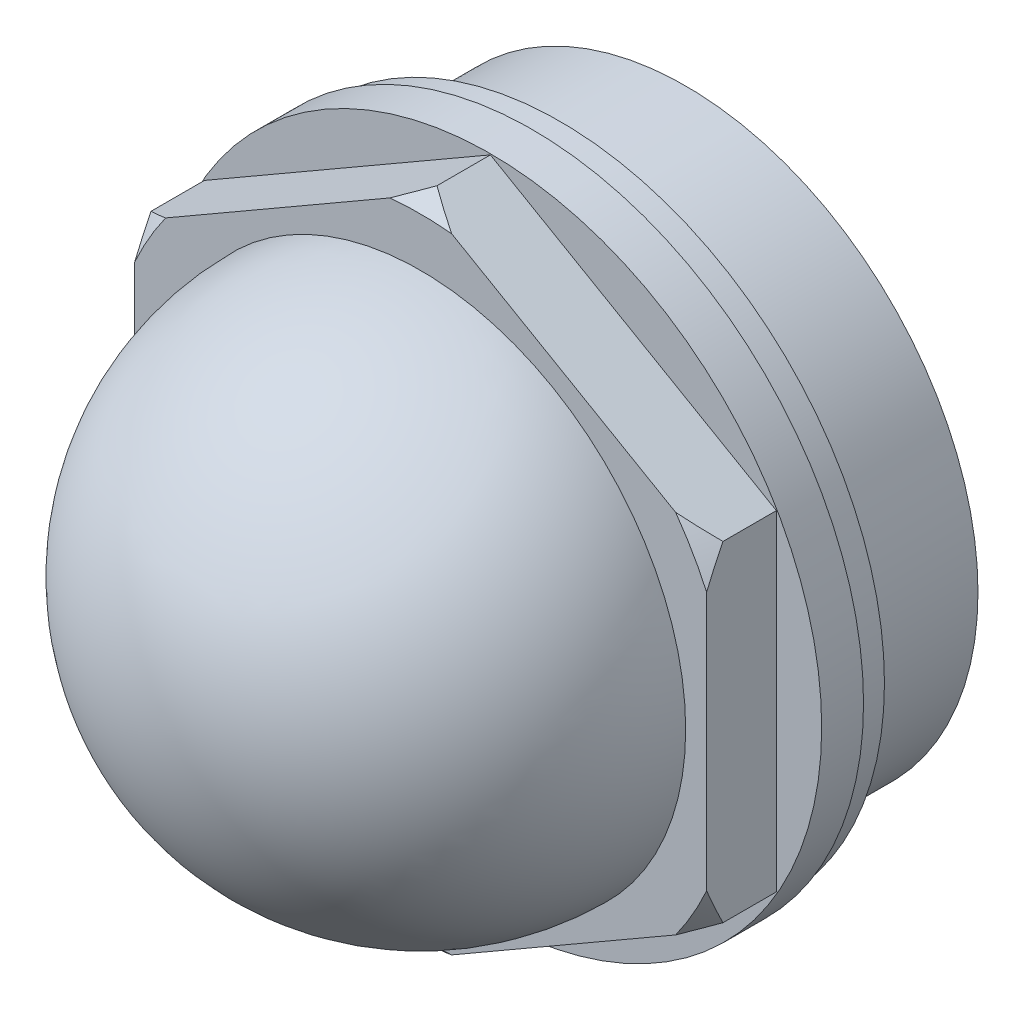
ISO-10303-21;
HEADER;
FILE_DESCRIPTION(('STEP AP214'),'2;1');
FILE_NAME('part.step','',(''),(''),'','','');
FILE_SCHEMA(('AUTOMOTIVE_DESIGN { 1 0 10303 214 1 1 1 1 }'));
ENDSEC;
DATA;
#1=APPLICATION_CONTEXT('core data for automotive mechanical design processes');
#2=APPLICATION_PROTOCOL_DEFINITION('international standard','automotive_design',2000,#1);
#3=PRODUCT_CONTEXT('',#1,'mechanical');
#4=PRODUCT('Part','Part','',(#3));
#5=PRODUCT_RELATED_PRODUCT_CATEGORY('part','',(#4));
#6=PRODUCT_DEFINITION_FORMATION('','',#4);
#7=PRODUCT_DEFINITION_CONTEXT('part definition',#1,'design');
#8=PRODUCT_DEFINITION('design','',#6,#7);
#9=PRODUCT_DEFINITION_SHAPE('','',#8);
#10=(LENGTH_UNIT() NAMED_UNIT(*) SI_UNIT(.MILLI.,.METRE.));
#11=(NAMED_UNIT(*) PLANE_ANGLE_UNIT() SI_UNIT($,.RADIAN.));
#12=(NAMED_UNIT(*) SI_UNIT($,.STERADIAN.) SOLID_ANGLE_UNIT());
#13=UNCERTAINTY_MEASURE_WITH_UNIT(LENGTH_MEASURE(1.E-05),#10,'distance_accuracy_value','');
#14=(GEOMETRIC_REPRESENTATION_CONTEXT(3) GLOBAL_UNCERTAINTY_ASSIGNED_CONTEXT((#13)) GLOBAL_UNIT_ASSIGNED_CONTEXT((#10,
#11,#12)) REPRESENTATION_CONTEXT('',''));
#15=CARTESIAN_POINT('',(0.,0.,0.));
#16=DIRECTION('',(0.,0.,1.));
#17=DIRECTION('',(1.,0.,0.));
#18=AXIS2_PLACEMENT_3D('',#15,#16,#17);
#19=CARTESIAN_POINT('',(0.,0.,-10.));
#20=DIRECTION('',(0.,0.,-1.));
#21=DIRECTION('',(1.,0.,0.));
#22=AXIS2_PLACEMENT_3D('',#19,#20,#21);
#23=PLANE('',#22);
#24=CARTESIAN_POINT('',(0.,0.,-10.));
#25=DIRECTION('',(0.,0.,-1.));
#26=DIRECTION('',(1.,0.,0.));
#27=AXIS2_PLACEMENT_3D('',#24,#25,#26);
#28=CIRCLE('',#27,19.476);
#29=CARTESIAN_POINT('',(19.476,0.,-10.));
#30=VERTEX_POINT('',#29);
#31=EDGE_CURVE('E9',#30,#30,#28,.T.);
#32=ORIENTED_EDGE('',*,*,#31,.T.);
#33=EDGE_LOOP('',(#32));
#34=FACE_BOUND('',#33,.T.);
#35=ADVANCED_FACE('F14',(#34),#23,.T.);
#36=CARTESIAN_POINT('',(0.,0.,-20.5));
#37=DIRECTION('',(0.,0.,-1.));
#38=DIRECTION('',(1.,0.,0.));
#39=AXIS2_PLACEMENT_3D('',#36,#37,#38);
#40=CYLINDRICAL_SURFACE('',#39,19.476);
#41=ORIENTED_EDGE('',*,*,#31,.F.);
#42=EDGE_LOOP('',(#41));
#43=FACE_BOUND('',#42,.T.);
#44=CARTESIAN_POINT('',(0.,0.,-9.));
#45=DIRECTION('',(0.,0.,-1.));
#46=DIRECTION('',(1.,0.,0.));
#47=AXIS2_PLACEMENT_3D('',#44,#45,#46);
#48=CIRCLE('',#47,19.476);
#49=CARTESIAN_POINT('',(19.476,0.,-9.));
#50=VERTEX_POINT('',#49);
#51=EDGE_CURVE('E21',#50,#50,#48,.T.);
#52=ORIENTED_EDGE('',*,*,#51,.T.);
#53=EDGE_LOOP('',(#52));
#54=FACE_BOUND('',#53,.T.);
#55=ADVANCED_FACE('F261',(#43,#54),#40,.T.);
#56=CARTESIAN_POINT('',(0.,-19.476,-9.));
#57=DIRECTION('',(0.,0.,-1.));
#58=DIRECTION('',(1.,0.,0.));
#59=AXIS2_PLACEMENT_3D('',#56,#57,#58);
#60=PLANE('',#59);
#61=CARTESIAN_POINT('',(0.,0.,-9.));
#62=DIRECTION('',(0.,0.,-1.));
#63=DIRECTION('',(1.,0.,0.));
#64=AXIS2_PLACEMENT_3D('',#61,#62,#63);
#65=CIRCLE('',#64,20.955);
#66=CARTESIAN_POINT('',(20.955,0.,-9.));
#67=VERTEX_POINT('',#66);
#68=EDGE_CURVE('E256',#67,#67,#65,.T.);
#69=ORIENTED_EDGE('',*,*,#68,.T.);
#70=EDGE_LOOP('',(#69));
#71=FACE_BOUND('',#70,.T.);
#72=ORIENTED_EDGE('',*,*,#51,.F.);
#73=EDGE_LOOP('',(#72));
#74=FACE_BOUND('',#73,.T.);
#75=ADVANCED_FACE('F263',(#71,#74),#60,.T.);
#76=CARTESIAN_POINT('',(0.,0.,-20.5));
#77=DIRECTION('',(0.,0.,-1.));
#78=DIRECTION('',(1.,0.,0.));
#79=AXIS2_PLACEMENT_3D('',#76,#77,#78);
#80=CYLINDRICAL_SURFACE('',#79,20.955);
#81=ORIENTED_EDGE('',*,*,#68,.F.);
#82=EDGE_LOOP('',(#81));
#83=FACE_BOUND('',#82,.T.);
#84=CARTESIAN_POINT('',(0.,0.,0.));
#85=DIRECTION('',(0.,0.,-1.));
#86=DIRECTION('',(1.,0.,0.));
#87=AXIS2_PLACEMENT_3D('',#84,#85,#86);
#88=CIRCLE('',#87,20.955);
#89=CARTESIAN_POINT('',(20.955,0.,0.));
#90=VERTEX_POINT('',#89);
#91=EDGE_CURVE('E253',#90,#90,#88,.T.);
#92=ORIENTED_EDGE('',*,*,#91,.T.);
#93=EDGE_LOOP('',(#92));
#94=FACE_BOUND('',#93,.T.);
#95=ADVANCED_FACE('F265',(#83,#94),#80,.T.);
#96=CARTESIAN_POINT('',(0.,-23.25,0.));
#97=DIRECTION('',(0.,0.,1.));
#98=DIRECTION('',(-1.,0.,0.));
#99=AXIS2_PLACEMENT_3D('',#96,#97,#98);
#100=PLANE('',#99);
#101=ORIENTED_EDGE('',*,*,#91,.F.);
#102=EDGE_LOOP('',(#101));
#103=FACE_BOUND('',#102,.T.);
#104=CARTESIAN_POINT('',(0.,0.,0.));
#105=DIRECTION('',(0.,0.,-1.));
#106=DIRECTION('',(1.,0.,0.));
#107=AXIS2_PLACEMENT_3D('',#104,#105,#106);
#108=CIRCLE('',#107,23.25);
#109=CARTESIAN_POINT('',(23.25,0.,0.));
#110=VERTEX_POINT('',#109);
#111=EDGE_CURVE('E250',#110,#110,#108,.T.);
#112=ORIENTED_EDGE('',*,*,#111,.T.);
#113=EDGE_LOOP('',(#112));
#114=FACE_BOUND('',#113,.T.);
#115=ADVANCED_FACE('F274',(#103,#114),#100,.F.);
#116=CARTESIAN_POINT('',(0.,0.,-20.5));
#117=DIRECTION('',(0.,0.,-1.));
#118=DIRECTION('',(1.,0.,0.));
#119=AXIS2_PLACEMENT_3D('',#116,#117,#118);
#120=CYLINDRICAL_SURFACE('',#119,23.25);
#121=CARTESIAN_POINT('',(0.,0.,2.));
#122=DIRECTION('',(0.,0.,-1.));
#123=DIRECTION('',(1.,0.,0.));
#124=AXIS2_PLACEMENT_3D('',#121,#122,#123);
#125=CIRCLE('',#124,23.25);
#126=CARTESIAN_POINT('',(23.25,0.,2.));
#127=VERTEX_POINT('',#126);
#128=EDGE_CURVE('E247',#127,#127,#125,.T.);
#129=ORIENTED_EDGE('',*,*,#128,.T.);
#130=EDGE_LOOP('',(#129));
#131=FACE_BOUND('',#130,.T.);
#132=ORIENTED_EDGE('',*,*,#111,.F.);
#133=EDGE_LOOP('',(#132));
#134=FACE_BOUND('',#133,.T.);
#135=ADVANCED_FACE('F480',(#131,#134),#120,.T.);
#136=CARTESIAN_POINT('',(0.,-23.25,2.));
#137=DIRECTION('',(0.,0.,-1.));
#138=DIRECTION('',(1.,0.,0.));
#139=AXIS2_PLACEMENT_3D('',#136,#137,#138);
#140=PLANE('',#139);
#141=CARTESIAN_POINT('',(0.,0.,2.));
#142=DIRECTION('',(0.,0.,-1.));
#143=DIRECTION('',(1.,0.,0.));
#144=AXIS2_PLACEMENT_3D('',#141,#142,#143);
#145=CIRCLE('',#144,23.75);
#146=CARTESIAN_POINT('',(23.75,0.,2.));
#147=VERTEX_POINT('',#146);
#148=EDGE_CURVE('E244',#147,#147,#145,.T.);
#149=ORIENTED_EDGE('',*,*,#148,.T.);
#150=EDGE_LOOP('',(#149));
#151=FACE_BOUND('',#150,.T.);
#152=ORIENTED_EDGE('',*,*,#128,.F.);
#153=EDGE_LOOP('',(#152));
#154=FACE_BOUND('',#153,.T.);
#155=ADVANCED_FACE('F470',(#151,#154),#140,.T.);
#156=CARTESIAN_POINT('',(0.,0.,-20.5));
#157=DIRECTION('',(0.,0.,-1.));
#158=DIRECTION('',(1.,0.,0.));
#159=AXIS2_PLACEMENT_3D('',#156,#157,#158);
#160=CYLINDRICAL_SURFACE('',#159,23.75);
#161=ORIENTED_EDGE('',*,*,#148,.F.);
#162=EDGE_LOOP('',(#161));
#163=FACE_BOUND('',#162,.T.);
#164=CARTESIAN_POINT('',(0.,0.,5.));
#165=DIRECTION('',(0.,0.,-1.));
#166=DIRECTION('',(1.,0.,0.));
#167=AXIS2_PLACEMENT_3D('',#164,#165,#166);
#168=CIRCLE('',#167,23.75);
#169=CARTESIAN_POINT('',(23.75,0.,5.));
#170=VERTEX_POINT('',#169);
#171=EDGE_CURVE('E240',#170,#170,#168,.T.);
#172=ORIENTED_EDGE('',*,*,#171,.T.);
#173=EDGE_LOOP('',(#172));
#174=FACE_BOUND('',#173,.T.);
#175=ADVANCED_FACE('F461',(#163,#174),#160,.T.);
#176=CARTESIAN_POINT('',(0.,-23.6713610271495,5.));
#177=DIRECTION('',(0.,0.,-1.));
#178=DIRECTION('',(1.,0.,0.));
#179=AXIS2_PLACEMENT_3D('',#176,#177,#178);
#180=PLANE('',#179);
#181=ORIENTED_EDGE('',*,*,#171,.F.);
#182=EDGE_LOOP('',(#181));
#183=FACE_BOUND('',#182,.T.);
#184=DIRECTION('',(0.,-1.,0.));
#185=VECTOR('',#184,1.);
#186=CARTESIAN_POINT('',(20.499999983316,11.8356805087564,5.));
#187=LINE('',#186,#185);
#188=CARTESIAN_POINT('',(20.499999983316,11.8356805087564,5.));
#189=VERTEX_POINT('',#188);
#190=CARTESIAN_POINT('',(20.499999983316,-11.8356805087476,5.));
#191=VERTEX_POINT('',#190);
#192=EDGE_CURVE('E124',#189,#191,#187,.T.);
#193=ORIENTED_EDGE('',*,*,#192,.T.);
#194=DIRECTION('',(-0.866025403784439,-0.5,0.));
#195=VECTOR('',#194,1.);
#196=CARTESIAN_POINT('',(20.499999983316,-11.8356805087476,5.));
#197=LINE('',#196,#195);
#198=CARTESIAN_POINT('',(7.89646126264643E-12,-23.671361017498,5.));
#199=VERTEX_POINT('',#198);
#200=EDGE_CURVE('E108',#191,#199,#197,.T.);
#201=ORIENTED_EDGE('',*,*,#200,.T.);
#202=DIRECTION('',(-0.866025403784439,0.5,0.));
#203=VECTOR('',#202,1.);
#204=CARTESIAN_POINT('',(7.89646126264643E-12,-23.671361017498,5.));
#205=LINE('',#204,#203);
#206=CARTESIAN_POINT('',(-20.4999999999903,-11.8356804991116,5.));
#207=VERTEX_POINT('',#206);
#208=EDGE_CURVE('E121',#199,#207,#205,.T.);
#209=ORIENTED_EDGE('',*,*,#208,.T.);
#210=DIRECTION('',(7.0545645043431E-10,1.,0.));
#211=VECTOR('',#210,1.);
#212=CARTESIAN_POINT('',(-20.4999999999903,-11.8356804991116,5.));
#213=LINE('',#212,#211);
#214=CARTESIAN_POINT('',(-20.5000000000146,11.835680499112,5.));
#215=VERTEX_POINT('',#214);
#216=EDGE_CURVE('E129',#207,#215,#213,.T.);
#217=ORIENTED_EDGE('',*,*,#216,.T.);
#218=DIRECTION('',(0.866025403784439,0.5,0.));
#219=VECTOR('',#218,1.);
#220=CARTESIAN_POINT('',(-20.4999999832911,11.8356805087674,5.));
#221=LINE('',#220,#219);
#222=CARTESIAN_POINT('',(2.8865798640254E-12,23.6713610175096,5.));
#223=VERTEX_POINT('',#222);
#224=EDGE_CURVE('E28',#215,#223,#221,.T.);
#225=ORIENTED_EDGE('',*,*,#224,.T.);
#226=DIRECTION('',(0.866025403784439,-0.5,0.));
#227=VECTOR('',#226,1.);
#228=CARTESIAN_POINT('',(2.8865798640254E-12,23.6713610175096,5.));
#229=LINE('',#228,#227);
#230=EDGE_CURVE('E135',#223,#189,#229,.T.);
#231=ORIENTED_EDGE('',*,*,#230,.T.);
#232=EDGE_LOOP('',(#193,#201,#209,#217,#225,#231));
#233=FACE_BOUND('',#232,.T.);
#234=ADVANCED_FACE('F120',(#183,#233),#180,.F.);
#235=CARTESIAN_POINT('',(20.499999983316,-11.8356805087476,5.));
#236=DIRECTION('',(-0.5,0.866025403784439,0.));
#237=DIRECTION('',(0.866025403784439,0.5,0.));
#238=AXIS2_PLACEMENT_3D('',#235,#236,#237);
#239=PLANE('',#238);
#240=DIRECTION('',(0.,0.,1.));
#241=VECTOR('',#240,1.);
#242=CARTESIAN_POINT('',(7.89646126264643E-12,-23.671361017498,5.));
#243=LINE('',#242,#241);
#244=CARTESIAN_POINT('',(7.89646126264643E-12,-23.671361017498,8.828638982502));
#245=VERTEX_POINT('',#244);
#246=EDGE_CURVE('E104',#199,#245,#243,.T.);
#247=ORIENTED_EDGE('',*,*,#246,.F.);
#248=ORIENTED_EDGE('',*,*,#200,.F.);
#249=DIRECTION('',(0.,0.,1.));
#250=VECTOR('',#249,1.);
#251=CARTESIAN_POINT('',(20.499999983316,-11.8356805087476,5.));
#252=LINE('',#251,#250);
#253=CARTESIAN_POINT('',(20.499999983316,-11.8356805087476,8.828638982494));
#254=VERTEX_POINT('',#253);
#255=EDGE_CURVE('E138',#191,#254,#252,.T.);
#256=ORIENTED_EDGE('',*,*,#255,.T.);
#257=CARTESIAN_POINT('',(-0.932149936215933,-24.209538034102,8.27252313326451));
#258=CARTESIAN_POINT('',(-0.631278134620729,-24.0358296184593,8.45765667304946));
#259=CARTESIAN_POINT('',(-0.328477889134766,-23.8610078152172,8.63867011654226));
#260=CARTESIAN_POINT('',(0.281284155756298,-23.5089615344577,8.99133702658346));
#261=CARTESIAN_POINT('',(0.588247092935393,-23.3317364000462,9.1629878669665));
#262=CARTESIAN_POINT('',(1.20769231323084,-22.9740995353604,9.49636216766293));
#263=CARTESIAN_POINT('',(1.52019160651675,-22.7936779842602,9.65804374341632));
#264=CARTESIAN_POINT('',(2.14960713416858,-22.4302847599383,9.96934084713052));
#265=CARTESIAN_POINT('',(2.46652301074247,-22.2473132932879,10.1189573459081));
#266=CARTESIAN_POINT('',(3.42600532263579,-21.6933559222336,10.5483478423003));
#267=CARTESIAN_POINT('',(4.07566559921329,-21.3182743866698,10.8077633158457));
#268=CARTESIAN_POINT('',(5.06252728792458,-20.7485095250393,11.1458794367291));
#269=CARTESIAN_POINT('',(5.39329054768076,-20.557543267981,11.2500246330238));
#270=CARTESIAN_POINT('',(6.05876635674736,-20.1733306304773,11.4397674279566));
#271=CARTESIAN_POINT('',(6.39347816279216,-19.9800846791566,11.5253684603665));
#272=CARTESIAN_POINT('',(7.01566278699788,-19.6208662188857,11.6650980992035));
#273=CARTESIAN_POINT('',(7.30266500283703,-19.4551654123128,11.7220242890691));
#274=CARTESIAN_POINT('',(7.8783264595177,-19.1228071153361,11.8204979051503));
#275=CARTESIAN_POINT('',(8.1669836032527,-18.9561508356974,11.8620616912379));
#276=CARTESIAN_POINT('',(8.90116892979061,-18.5322687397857,11.9472619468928));
#277=CARTESIAN_POINT('',(9.34768564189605,-18.2744721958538,11.9800225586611));
#278=CARTESIAN_POINT('',(10.2417216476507,-17.758300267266,12.0064971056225));
#279=CARTESIAN_POINT('',(10.6892412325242,-17.4999247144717,12.000197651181));
#280=CARTESIAN_POINT('',(11.5848019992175,-16.9828724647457,11.9486598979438));
#281=CARTESIAN_POINT('',(12.0328348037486,-16.7242006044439,11.9032290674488));
#282=CARTESIAN_POINT('',(12.9247577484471,-16.2092486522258,11.7749424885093));
#283=CARTESIAN_POINT('',(13.3686485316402,-15.9529681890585,11.6920926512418));
#284=CARTESIAN_POINT('',(14.1480865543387,-15.5029594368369,11.5151715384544));
#285=CARTESIAN_POINT('',(14.4848598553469,-15.3085232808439,11.4281719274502));
#286=CARTESIAN_POINT('',(15.15438154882,-14.9219747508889,11.2354649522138));
#287=CARTESIAN_POINT('',(15.4871294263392,-14.7298626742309,11.129755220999));
#288=CARTESIAN_POINT('',(16.4796411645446,-14.1568357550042,10.7868082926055));
#289=CARTESIAN_POINT('',(17.1328593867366,-13.779700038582,10.5239455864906));
#290=CARTESIAN_POINT('',(18.0956027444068,-13.2238599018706,10.090043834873));
#291=CARTESIAN_POINT('',(18.4123345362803,-13.0409947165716,9.93954472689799));
#292=CARTESIAN_POINT('',(19.0413842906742,-12.6778126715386,9.62656805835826));
#293=CARTESIAN_POINT('',(19.3537019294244,-12.4974959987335,9.46408962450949));
#294=CARTESIAN_POINT('',(19.9728838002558,-12.1400111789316,9.12915327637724));
#295=CARTESIAN_POINT('',(20.2797637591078,-11.9628339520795,8.95673389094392));
#296=CARTESIAN_POINT('',(20.8893722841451,-11.610876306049,8.60259181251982));
#297=CARTESIAN_POINT('',(21.192101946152,-11.4360952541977,8.42087163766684));
#298=CARTESIAN_POINT('',(21.4929091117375,-11.2624241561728,8.235059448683));
#299=B_SPLINE_CURVE_WITH_KNOTS('',3,(#257,#258,#259,#260,#261,#262,#263,#264,#265,#266,#267,
#268,#269,#270,#271,#272,#273,#274,#275,#276,#277,#278,#279,#280,#281,#282,#283,#284,#285,#286,
#287,#288,#289,#290,#291,#292,#293,#294,#295,#296,#297,#298),.UNSPECIFIED.,.F.,.F.,(4,2,2,2,2,2,
2,2,2,2,2,2,2,2,2,2,2,2,2,2,4),(0.,1.18100812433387,2.36234583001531,3.54834911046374,
4.73425686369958,7.11235226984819,8.29962168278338,9.48667106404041,10.4950969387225,
11.5024457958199,13.0508162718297,14.5997175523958,16.1562834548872,17.7126035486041,
18.9075760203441,20.1026997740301,22.4958137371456,23.6821388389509,24.8685505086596,
26.0506382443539,27.2324076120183),.UNSPECIFIED.);
#300=CARTESIAN_POINT('',(18.2811892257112,-13.1167114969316,10.));
#301=VERTEX_POINT('',#300);
#302=EDGE_CURVE('E226',#301,#254,#299,.T.);
#303=ORIENTED_EDGE('',*,*,#302,.F.);
#304=DIRECTION('',(-0.866025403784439,-0.5,0.));
#305=VECTOR('',#304,1.);
#306=CARTESIAN_POINT('',(20.499999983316,-11.8356805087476,10.));
#307=LINE('',#306,#305);
#308=CARTESIAN_POINT('',(2.21881075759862,-22.390330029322,10.));
#309=VERTEX_POINT('',#308);
#310=EDGE_CURVE('E422',#301,#309,#307,.T.);
#311=ORIENTED_EDGE('',*,*,#310,.T.);
#312=EDGE_CURVE('E110',#245,#309,#299,.T.);
#313=ORIENTED_EDGE('',*,*,#312,.F.);
#314=EDGE_LOOP('',(#247,#248,#256,#303,#311,#313));
#315=FACE_BOUND('',#314,.T.);
#316=ADVANCED_FACE('F106',(#315),#239,.F.);
#317=CARTESIAN_POINT('',(7.89646126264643E-12,-23.671361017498,5.));
#318=DIRECTION('',(0.5,0.866025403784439,0.));
#319=DIRECTION('',(0.866025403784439,-0.5,0.));
#320=AXIS2_PLACEMENT_3D('',#317,#318,#319);
#321=PLANE('',#320);
#322=DIRECTION('',(0.,0.,1.));
#323=VECTOR('',#322,1.);
#324=CARTESIAN_POINT('',(-20.4999999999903,-11.8356804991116,5.));
#325=LINE('',#324,#323);
#326=CARTESIAN_POINT('',(-20.4999999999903,-11.8356804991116,8.82863897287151));
#327=VERTEX_POINT('',#326);
#328=EDGE_CURVE('E115',#207,#327,#325,.T.);
#329=ORIENTED_EDGE('',*,*,#328,.F.);
#330=ORIENTED_EDGE('',*,*,#208,.F.);
#331=ORIENTED_EDGE('',*,*,#246,.T.);
#332=CARTESIAN_POINT('',(-21.4929091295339,-11.262424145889,8.23505943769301));
#333=CARTESIAN_POINT('',(-21.1912557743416,-11.4365837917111,8.42139412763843));
#334=CARTESIAN_POINT('',(-20.8876690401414,-11.611859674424,8.60361404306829));
#335=CARTESIAN_POINT('',(-20.2763197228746,-11.9648223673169,8.95870149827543));
#336=CARTESIAN_POINT('',(-19.9685559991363,-12.142509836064,9.13156641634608));
#337=CARTESIAN_POINT('',(-19.3474822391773,-12.5010869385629,9.46738053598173));
#338=CARTESIAN_POINT('',(-19.0341550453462,-12.6819864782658,9.63028768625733));
#339=CARTESIAN_POINT('',(-18.4030596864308,-13.0463495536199,9.9440332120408));
#340=CARTESIAN_POINT('',(-18.0852918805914,-13.229812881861,10.0948725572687));
#341=CARTESIAN_POINT('',(-17.1231752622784,-13.7852911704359,10.5279362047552));
#342=CARTESIAN_POINT('',(-16.4716861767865,-14.1614285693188,10.7897847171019));
#343=CARTESIAN_POINT('',(-15.4819546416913,-14.7328503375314,11.1314279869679));
#344=CARTESIAN_POINT('',(-15.1502153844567,-14.9243800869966,11.2367274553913));
#345=CARTESIAN_POINT('',(-14.4827397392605,-15.3097473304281,11.4287182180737));
#346=CARTESIAN_POINT('',(-14.1470041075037,-15.5035843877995,11.5154129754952));
#347=CARTESIAN_POINT('',(-13.5235263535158,-15.8635494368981,11.6569412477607));
#348=CARTESIAN_POINT('',(-13.2362674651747,-16.029398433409,11.7146168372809));
#349=CARTESIAN_POINT('',(-12.6600616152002,-16.3620710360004,11.8145843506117));
#350=CARTESIAN_POINT('',(-12.3711167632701,-16.5288934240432,11.8568925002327));
#351=CARTESIAN_POINT('',(-11.6368936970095,-16.952797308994,11.9438743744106));
#352=CARTESIAN_POINT('',(-11.1906119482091,-17.2104581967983,11.9777232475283));
#353=CARTESIAN_POINT('',(-10.2969735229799,-17.7264005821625,12.006420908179));
#354=CARTESIAN_POINT('',(-9.8496165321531,-17.9846822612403,12.0012564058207));
#355=CARTESIAN_POINT('',(-8.95432563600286,-18.5015787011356,11.9519961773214));
#356=CARTESIAN_POINT('',(-8.50639967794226,-18.7601888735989,11.9077094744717));
#357=CARTESIAN_POINT('',(-7.61462113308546,-19.2750574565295,11.7816711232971));
#358=CARTESIAN_POINT('',(-7.170767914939,-19.5313162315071,11.699925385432));
#359=CARTESIAN_POINT('',(-6.39241528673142,-19.9806983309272,11.5251344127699));
#360=CARTESIAN_POINT('',(-6.05668749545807,-20.1745308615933,11.439237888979));
#361=CARTESIAN_POINT('',(-5.38920652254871,-20.5599011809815,11.2487963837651));
#362=CARTESIAN_POINT('',(-5.05745361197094,-20.751438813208,11.1442501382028));
#363=CARTESIAN_POINT('',(-4.39789411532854,-21.132235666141,10.9180532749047));
#364=CARTESIAN_POINT('',(-4.07009337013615,-21.3214915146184,10.7963800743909));
#365=CARTESIAN_POINT('',(-3.41900419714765,-21.6973980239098,10.5377128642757));
#366=CARTESIAN_POINT('',(-3.09571665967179,-21.8840481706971,10.4007158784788));
#367=CARTESIAN_POINT('',(-2.45703665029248,-22.2527902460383,10.1145275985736));
#368=CARTESIAN_POINT('',(-2.14159724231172,-22.434909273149,9.96547541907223));
#369=CARTESIAN_POINT('',(-1.51510159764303,-22.7966167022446,9.65542819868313));
#370=CARTESIAN_POINT('',(-1.20404610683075,-22.976204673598,9.4944311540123));
#371=CARTESIAN_POINT('',(-0.586391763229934,-23.3328075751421,9.16195781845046));
#372=CARTESIAN_POINT('',(-0.279790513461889,-23.5098238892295,8.99048744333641));
#373=CARTESIAN_POINT('',(0.329232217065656,-23.8614433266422,8.63821954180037));
#374=CARTESIAN_POINT('',(0.631655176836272,-24.0360473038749,8.45742542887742));
#375=CARTESIAN_POINT('',(0.932149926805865,-24.20953802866,8.27252313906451));
#376=B_SPLINE_CURVE_WITH_KNOTS('',3,(#332,#333,#334,#335,#336,#337,#338,#339,#340,#341,#342,
#343,#344,#345,#346,#347,#348,#349,#350,#351,#352,#353,#354,#355,#356,#357,#358,#359,#360,#361,
#362,#363,#364,#365,#366,#367,#368,#369,#370,#371,#372,#373,#374,#375),.UNSPECIFIED.,.F.,.F.,(4,
2,2,2,2,2,2,2,2,2,2,2,2,2,2,2,2,2,2,2,2,4),(0.,1.18509371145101,2.37051783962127,
3.56064404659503,4.75067452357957,7.13714376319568,8.32858718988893,9.51980864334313,
10.529493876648,11.5381099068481,13.0858835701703,14.6341845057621,16.1900855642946,
17.7457412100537,18.9364777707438,20.1272950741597,21.3196975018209,22.5123319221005,
23.6927633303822,24.8733932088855,26.0533622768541,27.2329023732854),.UNSPECIFIED.);
#377=CARTESIAN_POINT('',(-2.21881075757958,-22.390330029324,10.));
#378=VERTEX_POINT('',#377);
#379=EDGE_CURVE('E219',#378,#245,#376,.T.);
#380=ORIENTED_EDGE('',*,*,#379,.F.);
#381=DIRECTION('',(-0.866025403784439,0.5,0.));
#382=VECTOR('',#381,1.);
#383=CARTESIAN_POINT('',(7.89646126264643E-12,-23.671361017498,10.));
#384=LINE('',#383,#382);
#385=CARTESIAN_POINT('',(-18.2811892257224,-13.116711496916,10.));
#386=VERTEX_POINT('',#385);
#387=EDGE_CURVE('E413',#378,#386,#384,.T.);
#388=ORIENTED_EDGE('',*,*,#387,.T.);
#389=EDGE_CURVE('E225',#327,#386,#376,.T.);
#390=ORIENTED_EDGE('',*,*,#389,.F.);
#391=EDGE_LOOP('',(#329,#330,#331,#380,#388,#390));
#392=FACE_BOUND('',#391,.T.);
#393=ADVANCED_FACE('F127',(#392),#321,.F.);
#394=CARTESIAN_POINT('',(-20.4999999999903,-11.8356804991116,5.));
#395=DIRECTION('',(1.,-7.0545645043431E-10,0.));
#396=DIRECTION('',(-7.0545645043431E-10,-1.,0.));
#397=AXIS2_PLACEMENT_3D('',#394,#395,#396);
#398=PLANE('',#397);
#399=DIRECTION('',(0.,0.,1.));
#400=VECTOR('',#399,1.);
#401=CARTESIAN_POINT('',(-20.4999999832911,11.8356805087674,5.));
#402=LINE('',#401,#400);
#403=CARTESIAN_POINT('',(-20.4999999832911,11.8356805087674,8.82863898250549));
#404=VERTEX_POINT('',#403);
#405=EDGE_CURVE('E145',#215,#404,#402,.T.);
#406=ORIENTED_EDGE('',*,*,#405,.F.);
#407=ORIENTED_EDGE('',*,*,#216,.F.);
#408=ORIENTED_EDGE('',*,*,#328,.T.);
#409=CARTESIAN_POINT('',(-20.4999999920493,-0.579203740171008,11.9918192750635));
#410=CARTESIAN_POINT('',(-20.4999999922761,-0.900717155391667,11.9827765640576));
#411=CARTESIAN_POINT('',(-20.4999999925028,-1.22199617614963,11.9661114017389));
#412=CARTESIAN_POINT('',(-20.4999999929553,-1.86337981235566,11.9179604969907));
#413=CARTESIAN_POINT('',(-20.4999999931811,-2.18348465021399,11.8864777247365));
#414=CARTESIAN_POINT('',(-20.4999999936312,-2.82145211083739,11.8091715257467));
#415=CARTESIAN_POINT('',(-20.4999999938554,-3.13931742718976,11.7633702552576));
#416=CARTESIAN_POINT('',(-20.4999999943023,-3.77276072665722,11.6580676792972));
#417=CARTESIAN_POINT('',(-20.4999999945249,-4.08833862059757,11.5985658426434));
#418=CARTESIAN_POINT('',(-20.499999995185,-5.02401631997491,11.4020873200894));
#419=CARTESIAN_POINT('',(-20.4999999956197,-5.64021507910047,11.2462376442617));
#420=CARTESIAN_POINT('',(-20.4999999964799,-6.85962826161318,10.8906537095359));
#421=CARTESIAN_POINT('',(-20.4999999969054,-7.46284259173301,10.6909191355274));
#422=CARTESIAN_POINT('',(-20.4999999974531,-8.23917285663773,10.4068809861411));
#423=CARTESIAN_POINT('',(-20.4999999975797,-8.41857157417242,10.3393329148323));
#424=CARTESIAN_POINT('',(-20.4999999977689,-8.68685137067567,10.2355760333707));
#425=CARTESIAN_POINT('',(-20.499999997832,-8.77619300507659,10.200563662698));
#426=CARTESIAN_POINT('',(-20.4999999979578,-8.95456178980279,10.129763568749));
#427=CARTESIAN_POINT('',(-20.4999999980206,-9.04358895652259,10.093975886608));
#428=CARTESIAN_POINT('',(-20.4999999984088,-9.594110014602,9.86995165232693));
#429=CARTESIAN_POINT('',(-20.4999999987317,-10.0516462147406,9.67188723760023));
#430=CARTESIAN_POINT('',(-20.4999999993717,-10.958750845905,9.2582008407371));
#431=CARTESIAN_POINT('',(-20.4999999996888,-11.4083176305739,9.04257528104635));
#432=CARTESIAN_POINT('',(-20.500000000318,-12.3002280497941,8.59609937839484));
#433=CARTESIAN_POINT('',(-20.5000000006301,-12.7425660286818,8.36523776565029));
#434=CARTESIAN_POINT('',(-20.5000000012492,-13.6201908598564,7.89058359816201));
#435=CARTESIAN_POINT('',(-20.5000000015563,-14.0554781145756,7.64679178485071));
#436=CARTESIAN_POINT('',(-20.5000000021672,-14.9215193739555,7.14696974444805));
#437=CARTESIAN_POINT('',(-20.5000000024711,-15.3522448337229,6.89089018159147));
#438=CARTESIAN_POINT('',(-20.5000000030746,-16.2077774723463,6.3690382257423));
#439=CARTESIAN_POINT('',(-20.5000000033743,-16.6325845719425,6.10326570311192));
#440=CARTESIAN_POINT('',(-20.5000000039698,-17.4766712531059,5.56343012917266));
#441=CARTESIAN_POINT('',(-20.5000000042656,-17.8959527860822,5.28937012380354));
#442=CARTESIAN_POINT('',(-20.5000000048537,-18.7296581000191,4.73394960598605));
#443=CARTESIAN_POINT('',(-20.5000000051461,-19.1440817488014,4.45258889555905));
#444=CARTESIAN_POINT('',(-20.5000000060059,-20.3629700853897,3.61126288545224));
#445=CARTESIAN_POINT('',(-20.5000000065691,-21.1612338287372,3.04230581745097));
#446=CARTESIAN_POINT('',(-20.5000000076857,-22.7440118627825,1.88548263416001));
#447=CARTESIAN_POINT('',(-20.5000000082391,-23.5285245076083,1.29761427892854));
#448=CARTESIAN_POINT('',(-20.5000000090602,-24.6924997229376,0.407818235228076));
#449=CARTESIAN_POINT('',(-20.500000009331,-25.0762923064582,0.111530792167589));
#450=CARTESIAN_POINT('',(-20.5000000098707,-25.8413197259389,-0.484332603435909));
#451=CARTESIAN_POINT('',(-20.5000000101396,-26.2225545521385,-0.783908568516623));
#452=CARTESIAN_POINT('',(-20.5000000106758,-26.9825720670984,-1.38591724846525));
#453=CARTESIAN_POINT('',(-20.500000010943,-27.3613554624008,-1.68834907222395));
#454=CARTESIAN_POINT('',(-20.5000000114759,-28.1167734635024,-2.29587224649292));
#455=CARTESIAN_POINT('',(-20.5000000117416,-28.4934081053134,-2.60096355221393));
#456=CARTESIAN_POINT('',(-20.5000000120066,-28.869068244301,-2.90724645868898));
#457=B_SPLINE_CURVE_WITH_KNOTS('',3,(#409,#410,#411,#412,#413,#414,#415,#416,#417,#418,#419,
#420,#421,#422,#423,#424,#425,#426,#427,#428,#429,#430,#431,#432,#433,#434,#435,#436,#437,#438,
#439,#440,#441,#442,#443,#444,#445,#446,#447,#448,#449,#450,#451,#452,#453,#454,#455,#456),
.UNSPECIFIED.,.F.,.F.,(4,2,2,2,2,2,2,2,2,2,2,2,2,2,2,2,2,2,2,2,2,2,2,4),(0.,0.964801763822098,
1.92941021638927,2.89253337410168,3.85569387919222,5.76045032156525,7.66522044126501,
8.2402878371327,8.52815458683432,8.8160061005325,10.3112050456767,11.8067093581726,
13.3033325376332,14.7998699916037,16.3030228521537,17.8061958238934,19.3088228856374,
20.8114907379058,23.751916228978,26.692691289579,28.1472373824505,29.601789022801,
31.055900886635,32.5099883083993),.UNSPECIFIED.);
#458=CARTESIAN_POINT('',(-20.4999999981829,-9.27361849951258,10.));
#459=VERTEX_POINT('',#458);
#460=EDGE_CURVE('E197',#459,#327,#457,.T.);
#461=ORIENTED_EDGE('',*,*,#460,.F.);
#462=DIRECTION('',(7.0545645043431E-10,1.,0.));
#463=VECTOR('',#462,1.);
#464=CARTESIAN_POINT('',(-20.4999999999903,-11.8356804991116,10.));
#465=LINE('',#464,#463);
#466=CARTESIAN_POINT('',(-20.4999999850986,9.2736185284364,10.));
#467=VERTEX_POINT('',#466);
#468=EDGE_CURVE('E421',#459,#467,#465,.T.);
#469=ORIENTED_EDGE('',*,*,#468,.T.);
#470=CARTESIAN_POINT('',(-20.4999999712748,28.8690682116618,-2.90724640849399));
#471=CARTESIAN_POINT('',(-20.4999999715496,28.479687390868,-2.58977776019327));
#472=CARTESIAN_POINT('',(-20.499999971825,28.0892602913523,-2.27358860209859));
#473=CARTESIAN_POINT('',(-20.4999999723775,27.3060892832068,-1.64407785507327));
#474=CARTESIAN_POINT('',(-20.4999999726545,26.9133453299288,-1.33075632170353));
#475=CARTESIAN_POINT('',(-20.4999999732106,26.1251945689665,-0.707193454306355));
#476=CARTESIAN_POINT('',(-20.4999999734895,25.7297868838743,-0.396953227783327));
#477=CARTESIAN_POINT('',(-20.4999999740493,24.9361969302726,0.219948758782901));
#478=CARTESIAN_POINT('',(-20.4999999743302,24.5380146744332,0.526610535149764));
#479=CARTESIAN_POINT('',(-20.4999999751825,23.3299093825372,1.44746370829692));
#480=CARTESIAN_POINT('',(-20.4999999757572,22.5152610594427,2.0555051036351));
#481=CARTESIAN_POINT('',(-20.4999999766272,21.281957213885,2.95186362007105));
#482=CARTESIAN_POINT('',(-20.4999999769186,20.8689873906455,3.24801874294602));
#483=CARTESIAN_POINT('',(-20.4999999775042,20.0388391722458,3.83436502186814));
#484=CARTESIAN_POINT('',(-20.4999999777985,19.6216608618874,4.12455629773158));
#485=CARTESIAN_POINT('',(-20.4999999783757,18.8035187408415,4.68385902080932));
#486=CARTESIAN_POINT('',(-20.4999999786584,18.402781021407,4.95330088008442));
#487=CARTESIAN_POINT('',(-20.4999999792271,17.5966809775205,5.48516266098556));
#488=CARTESIAN_POINT('',(-20.499999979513,17.1913187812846,5.74758277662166));
#489=CARTESIAN_POINT('',(-20.4999999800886,16.3753714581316,6.26446868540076));
#490=CARTESIAN_POINT('',(-20.4999999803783,15.9647847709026,6.51893201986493));
#491=CARTESIAN_POINT('',(-20.4999999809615,15.1380167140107,7.01861315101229));
#492=CARTESIAN_POINT('',(-20.4999999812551,14.7218353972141,7.26383103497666));
#493=CARTESIAN_POINT('',(-20.4999999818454,13.885072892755,7.74261741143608));
#494=CARTESIAN_POINT('',(-20.4999999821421,13.4645167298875,7.97622953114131));
#495=CARTESIAN_POINT('',(-20.4999999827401,12.6167993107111,8.43122944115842));
#496=CARTESIAN_POINT('',(-20.4999999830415,12.1896377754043,8.65261671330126));
#497=CARTESIAN_POINT('',(-20.499999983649,11.3284935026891,9.08108984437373));
#498=CARTESIAN_POINT('',(-20.4999999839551,10.8945149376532,9.28818406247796));
#499=CARTESIAN_POINT('',(-20.4999999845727,10.0191305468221,9.68594750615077));
#500=CARTESIAN_POINT('',(-20.499999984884,9.57772584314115,9.87661918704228));
#501=CARTESIAN_POINT('',(-20.4999999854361,8.79522922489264,10.1950410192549));
#502=CARTESIAN_POINT('',(-20.4999999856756,8.45578195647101,10.326833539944));
#503=CARTESIAN_POINT('',(-20.4999999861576,7.77242886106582,10.5783274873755));
#504=CARTESIAN_POINT('',(-20.4999999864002,7.42852314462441,10.6980292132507));
#505=CARTESIAN_POINT('',(-20.4999999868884,6.73652737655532,10.9239964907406));
#506=CARTESIAN_POINT('',(-20.499999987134,6.38843982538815,11.0302696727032));
#507=CARTESIAN_POINT('',(-20.499999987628,5.68809557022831,11.2281498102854));
#508=CARTESIAN_POINT('',(-20.4999999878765,5.33583876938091,11.3197564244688));
#509=CARTESIAN_POINT('',(-20.4999999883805,4.62146518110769,11.4884450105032));
#510=CARTESIAN_POINT('',(-20.499999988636,4.25928288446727,11.5652510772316));
#511=CARTESIAN_POINT('',(-20.4999999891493,3.5316191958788,11.7010916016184));
#512=CARTESIAN_POINT('',(-20.4999999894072,3.16613806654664,11.76012746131));
#513=CARTESIAN_POINT('',(-20.4999999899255,2.4313370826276,11.8595423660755));
#514=CARTESIAN_POINT('',(-20.4999999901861,2.06200836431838,11.8998567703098));
#515=CARTESIAN_POINT('',(-20.4999999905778,1.50676748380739,11.9455292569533));
#516=CARTESIAN_POINT('',(-20.4999999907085,1.32143976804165,11.9582880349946));
#517=CARTESIAN_POINT('',(-20.4999999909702,0.950502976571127,11.9788123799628));
#518=CARTESIAN_POINT('',(-20.4999999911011,0.764893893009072,11.9865778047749));
#519=CARTESIAN_POINT('',(-20.4999999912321,0.579203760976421,11.991819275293));
#520=B_SPLINE_CURVE_WITH_KNOTS('',3,(#470,#471,#472,#473,#474,#475,#476,#477,#478,#479,#480,
#481,#482,#483,#484,#485,#486,#487,#488,#489,#490,#491,#492,#493,#494,#495,#496,#497,#498,#499,
#500,#501,#502,#503,#504,#505,#506,#507,#508,#509,#510,#511,#512,#513,#514,#515,#516,#517,#518,
#519),.UNSPECIFIED.,.F.,.F.,(4,2,2,2,2,2,2,2,2,2,2,2,2,2,2,2,2,2,2,2,2,2,2,2,4),(0.,
1.50719457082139,3.01441828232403,4.52216543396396,6.02990570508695,9.07922658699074,
10.6037412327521,12.1282252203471,13.5768528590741,15.0254404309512,16.474471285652,
17.9234884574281,19.366566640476,20.8097059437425,22.2519939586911,23.6940659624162,
24.7862689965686,25.8784450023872,26.9699975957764,28.0615755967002,29.1718657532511,
30.2820682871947,31.3960761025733,31.9533165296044,32.5105728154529),.UNSPECIFIED.);
#521=EDGE_CURVE('E204',#404,#467,#520,.T.);
#522=ORIENTED_EDGE('',*,*,#521,.F.);
#523=EDGE_LOOP('',(#406,#407,#408,#461,#469,#522));
#524=FACE_BOUND('',#523,.T.);
#525=ADVANCED_FACE('F210',(#524),#398,.F.);
#526=CARTESIAN_POINT('',(-20.4999999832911,11.8356805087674,5.));
#527=DIRECTION('',(0.5,-0.866025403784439,0.));
#528=DIRECTION('',(-0.866025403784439,-0.5,0.));
#529=AXIS2_PLACEMENT_3D('',#526,#527,#528);
#530=PLANE('',#529);
#531=DIRECTION('',(0.,0.,1.));
#532=VECTOR('',#531,1.);
#533=CARTESIAN_POINT('',(2.8865798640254E-12,23.6713610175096,5.));
#534=LINE('',#533,#532);
#535=CARTESIAN_POINT('',(2.8865798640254E-12,23.6713610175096,8.82863898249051));
#536=VERTEX_POINT('',#535);
#537=EDGE_CURVE('E142',#223,#536,#534,.T.);
#538=ORIENTED_EDGE('',*,*,#537,.F.);
#539=ORIENTED_EDGE('',*,*,#224,.F.);
#540=ORIENTED_EDGE('',*,*,#405,.T.);
#541=CARTESIAN_POINT('',(0.93214993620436,24.2095380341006,8.27252313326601));
#542=CARTESIAN_POINT('',(0.631655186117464,24.0360473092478,8.4574254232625));
#543=CARTESIAN_POINT('',(0.32923222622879,23.861443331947,8.63821953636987));
#544=CARTESIAN_POINT('',(-0.279790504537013,23.5098238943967,8.99048743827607));
#545=CARTESIAN_POINT('',(-0.586391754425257,23.3328075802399,9.16195781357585));
#546=CARTESIAN_POINT('',(-1.2040460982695,22.9762046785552,9.49443114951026));
#547=CARTESIAN_POINT('',(-1.51510158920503,22.7966167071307,9.65542819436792));
#548=CARTESIAN_POINT('',(-2.14159723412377,22.4349092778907,9.96547541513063));
#549=CARTESIAN_POINT('',(-2.45703664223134,22.2527902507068,10.1145275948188));
#550=CARTESIAN_POINT('',(-3.09571665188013,21.8840481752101,10.4007158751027));
#551=CARTESIAN_POINT('',(-3.41900418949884,21.6973980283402,10.5377128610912));
#552=CARTESIAN_POINT('',(-4.07009336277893,21.3214915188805,10.7963800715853));
#553=CARTESIAN_POINT('',(-4.39789410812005,21.1322356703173,10.9180532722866));
#554=CARTESIAN_POINT('',(-5.05745360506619,20.7514388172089,11.1442501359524));
#555=CARTESIAN_POINT('',(-5.38920651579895,20.5599011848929,11.2487963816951));
#556=CARTESIAN_POINT('',(-6.05668748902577,20.1745308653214,11.4392378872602));
#557=CARTESIAN_POINT('',(-6.39241528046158,19.9806983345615,11.5251344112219));
#558=CARTESIAN_POINT('',(-7.17076790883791,19.5313162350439,11.6999253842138));
#559=CARTESIAN_POINT('',(-7.61462112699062,19.2750574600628,11.78167112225));
#560=CARTESIAN_POINT('',(-8.50639967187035,18.760188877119,11.9077094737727));
#561=CARTESIAN_POINT('',(-8.95432562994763,18.501578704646,11.9519961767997));
#562=CARTESIAN_POINT('',(-9.84961652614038,17.9846822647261,12.0012564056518));
#563=CARTESIAN_POINT('',(-10.296973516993,17.7264005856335,12.0064209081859));
#564=CARTESIAN_POINT('',(-11.1906119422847,17.2104582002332,11.9777232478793));
#565=CARTESIAN_POINT('',(-11.6368936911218,16.9527973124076,11.9438743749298));
#566=CARTESIAN_POINT('',(-12.3711167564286,16.5288934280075,11.8568925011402));
#567=CARTESIAN_POINT('',(-12.6600616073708,16.3620710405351,11.8145843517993));
#568=CARTESIAN_POINT('',(-13.2362674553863,16.0293984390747,11.7146168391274));
#569=CARTESIAN_POINT('',(-13.5235263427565,15.8635494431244,11.6569412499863));
#570=CARTESIAN_POINT('',(-14.1470040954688,15.5035843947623,11.5154129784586));
#571=CARTESIAN_POINT('',(-14.4827397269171,15.309747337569,11.4287182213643));
#572=CARTESIAN_POINT('',(-15.1502153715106,14.9243800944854,11.2367274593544));
#573=CARTESIAN_POINT('',(-15.481954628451,14.7328503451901,11.1314279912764));
#574=CARTESIAN_POINT('',(-16.4716861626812,14.1614285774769,10.789784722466));
#575=CARTESIAN_POINT('',(-17.1231752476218,13.7852911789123,10.527936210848));
#576=CARTESIAN_POINT('',(-18.0852918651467,13.2298128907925,10.0948725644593));
#577=CARTESIAN_POINT('',(-18.403059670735,13.0463495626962,9.94403321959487));
#578=CARTESIAN_POINT('',(-19.0341550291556,12.6819864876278,9.63028769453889));
#579=CARTESIAN_POINT('',(-19.3474822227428,12.5010869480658,9.46738054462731));
#580=CARTESIAN_POINT('',(-19.968555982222,12.1425098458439,9.13156642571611));
#581=CARTESIAN_POINT('',(-20.2763197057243,11.964822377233,8.95870150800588));
#582=CARTESIAN_POINT('',(-20.8876690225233,11.6118596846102,8.60361405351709));
#583=CARTESIAN_POINT('',(-21.1912557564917,11.4365838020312,8.42139413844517));
#584=CARTESIAN_POINT('',(-21.4929091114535,11.262424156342,8.235059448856));
#585=B_SPLINE_CURVE_WITH_KNOTS('',3,(#541,#542,#543,#544,#545,#546,#547,#548,#549,#550,#551,
#552,#553,#554,#555,#556,#557,#558,#559,#560,#561,#562,#563,#564,#565,#566,#567,#568,#569,#570,
#571,#572,#573,#574,#575,#576,#577,#578,#579,#580,#581,#582,#583,#584),.UNSPECIFIED.,.F.,.F.,(4,
2,2,2,2,2,2,2,2,2,2,2,2,2,2,2,2,2,2,2,2,4),(0.,1.17954009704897,2.35950916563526,
3.54013904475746,4.72057045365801,5.91320487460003,7.10560730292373,8.29642460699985,
9.48716116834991,11.0428168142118,12.5987178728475,14.1470188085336,15.6947924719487,
16.7034084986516,17.7130937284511,18.9043151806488,20.0957586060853,22.4822278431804,
23.6722583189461,24.8623845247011,26.0478086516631,27.2329023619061),.UNSPECIFIED.);
#586=CARTESIAN_POINT('',(-18.2811892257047,13.1167114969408,10.));
#587=VERTEX_POINT('',#586);
#588=EDGE_CURVE('E189',#587,#404,#585,.T.);
#589=ORIENTED_EDGE('',*,*,#588,.F.);
#590=DIRECTION('',(0.866025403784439,0.5,0.));
#591=VECTOR('',#590,1.);
#592=CARTESIAN_POINT('',(-20.4999999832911,11.8356805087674,10.));
#593=LINE('',#592,#591);
#594=CARTESIAN_POINT('',(-2.21881075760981,22.390330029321,10.));
#595=VERTEX_POINT('',#594);
#596=EDGE_CURVE('E424',#587,#595,#593,.T.);
#597=ORIENTED_EDGE('',*,*,#596,.T.);
#598=EDGE_CURVE('E196',#536,#595,#585,.T.);
#599=ORIENTED_EDGE('',*,*,#598,.F.);
#600=EDGE_LOOP('',(#538,#539,#540,#589,#597,#599));
#601=FACE_BOUND('',#600,.T.);
#602=ADVANCED_FACE('F177',(#601),#530,.F.);
#603=CARTESIAN_POINT('',(2.8865798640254E-12,23.6713610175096,5.));
#604=DIRECTION('',(-0.5,-0.866025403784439,0.));
#605=DIRECTION('',(-0.866025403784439,0.5,0.));
#606=AXIS2_PLACEMENT_3D('',#603,#604,#605);
#607=PLANE('',#606);
#608=DIRECTION('',(0.,0.,1.));
#609=VECTOR('',#608,1.);
#610=CARTESIAN_POINT('',(20.499999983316,11.8356805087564,5.));
#611=LINE('',#610,#609);
#612=CARTESIAN_POINT('',(20.499999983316,11.8356805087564,8.82863898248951));
#613=VERTEX_POINT('',#612);
#614=EDGE_CURVE('E140',#189,#613,#611,.T.);
#615=ORIENTED_EDGE('',*,*,#614,.F.);
#616=ORIENTED_EDGE('',*,*,#230,.F.);
#617=ORIENTED_EDGE('',*,*,#537,.T.);
#618=CARTESIAN_POINT('',(21.4929091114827,11.2624241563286,8.23505944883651));
#619=CARTESIAN_POINT('',(21.1921019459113,11.4360952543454,8.42087163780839));
#620=CARTESIAN_POINT('',(20.8893722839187,11.6108763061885,8.60259181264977));
#621=CARTESIAN_POINT('',(20.2797637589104,11.9628339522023,8.9567338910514));
#622=CARTESIAN_POINT('',(19.9728838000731,12.140011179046,9.12915327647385));
#623=CARTESIAN_POINT('',(19.3537019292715,12.4974959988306,9.46408962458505));
#624=CARTESIAN_POINT('',(19.0413842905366,12.6778126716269,9.62656805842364));
#625=CARTESIAN_POINT('',(18.4123345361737,13.0409947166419,9.93954472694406));
#626=CARTESIAN_POINT('',(18.095602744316,13.2238599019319,10.09004383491));
#627=CARTESIAN_POINT('',(17.1328593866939,13.7797000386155,10.5239455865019));
#628=CARTESIAN_POINT('',(16.479641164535,14.1568357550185,10.7868082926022));
#629=CARTESIAN_POINT('',(15.4871294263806,14.7298626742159,11.129755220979));
#630=CARTESIAN_POINT('',(15.1543815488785,14.921974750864,11.2354649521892));
#631=CARTESIAN_POINT('',(14.4848598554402,15.3085232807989,11.4281719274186));
#632=CARTESIAN_POINT('',(14.1480865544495,15.5029594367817,11.5151715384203));
#633=CARTESIAN_POINT('',(13.3686485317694,15.9529681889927,11.6920926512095));
#634=CARTESIAN_POINT('',(12.924757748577,16.2092486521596,11.7749424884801));
#635=CARTESIAN_POINT('',(12.0328348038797,16.724200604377,11.9032290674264));
#636=CARTESIAN_POINT('',(11.5848019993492,16.9828724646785,11.9486598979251));
#637=CARTESIAN_POINT('',(10.6892412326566,17.4999247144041,12.0001976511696));
#638=CARTESIAN_POINT('',(10.2417216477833,17.7583002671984,12.0064971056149));
#639=CARTESIAN_POINT('',(9.34768564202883,18.2744721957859,11.980022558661));
#640=CARTESIAN_POINT('',(8.90116892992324,18.5322687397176,11.9472619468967));
#641=CARTESIAN_POINT('',(8.16698360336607,18.9561508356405,11.8620616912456));
#642=CARTESIAN_POINT('',(7.87832645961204,19.1228071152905,11.8204979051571));
#643=CARTESIAN_POINT('',(7.30266500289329,19.4551654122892,11.7220242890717));
#644=CARTESIAN_POINT('',(7.01566278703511,19.6208662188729,11.665098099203));
#645=CARTESIAN_POINT('',(6.39347816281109,19.9800846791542,11.5253684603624));
#646=CARTESIAN_POINT('',(6.05876635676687,20.1733306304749,11.4397674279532));
#647=CARTESIAN_POINT('',(5.39329054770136,20.557543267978,11.2500246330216));
#648=CARTESIAN_POINT('',(5.06252728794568,20.748509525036,11.1458794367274));
#649=CARTESIAN_POINT('',(4.07566559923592,21.3182743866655,10.8077633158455));
#650=CARTESIAN_POINT('',(3.42600532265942,21.6933559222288,10.5483478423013));
#651=CARTESIAN_POINT('',(2.46652301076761,22.2473132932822,10.118957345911));
#652=CARTESIAN_POINT('',(2.14960713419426,22.4302847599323,9.96934084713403));
#653=CARTESIAN_POINT('',(1.5201916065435,22.7936779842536,9.65804374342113));
#654=CARTESIAN_POINT('',(1.20769231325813,22.9740995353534,9.4963621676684));
#655=CARTESIAN_POINT('',(0.588247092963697,23.3317364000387,9.16298786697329));
#656=CARTESIAN_POINT('',(0.281284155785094,23.50896153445,8.99133702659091));
#657=CARTESIAN_POINT('',(-0.328477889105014,23.8610078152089,8.63867011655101));
#658=CARTESIAN_POINT('',(-0.631278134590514,24.0358296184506,8.45765667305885));
#659=CARTESIAN_POINT('',(-0.932149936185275,24.209538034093,8.27252313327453));
#660=B_SPLINE_CURVE_WITH_KNOTS('',3,(#618,#619,#620,#621,#622,#623,#624,#625,#626,#627,#628,
#629,#630,#631,#632,#633,#634,#635,#636,#637,#638,#639,#640,#641,#642,#643,#644,#645,#646,#647,
#648,#649,#650,#651,#652,#653,#654,#655,#656,#657,#658,#659),.UNSPECIFIED.,.F.,.F.,(4,2,2,2,2,2,
2,2,2,2,2,2,2,2,2,2,2,2,2,2,4),(0.,1.18176936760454,2.36385710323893,3.55026877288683,
4.73659387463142,7.12970783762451,8.32483159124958,9.51980406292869,11.0761241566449,
12.6326900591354,14.1815913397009,15.72996181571,16.7373106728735,17.7457365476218,
18.9327859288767,20.1200553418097,22.498150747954,23.6840585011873,24.8700617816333,
26.0513994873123,27.2324076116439),.UNSPECIFIED.);
#661=CARTESIAN_POINT('',(2.21881075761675,22.3903300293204,10.));
#662=VERTEX_POINT('',#661);
#663=EDGE_CURVE('E181',#662,#536,#660,.T.);
#664=ORIENTED_EDGE('',*,*,#663,.F.);
#665=DIRECTION('',(0.866025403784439,-0.5,0.));
#666=VECTOR('',#665,1.);
#667=CARTESIAN_POINT('',(2.8865798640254E-12,23.6713610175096,10.));
#668=LINE('',#667,#666);
#669=CARTESIAN_POINT('',(18.2811892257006,13.1167114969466,10.));
#670=VERTEX_POINT('',#669);
#671=EDGE_CURVE('E429',#662,#670,#668,.T.);
#672=ORIENTED_EDGE('',*,*,#671,.T.);
#673=EDGE_CURVE('E188',#613,#670,#660,.T.);
#674=ORIENTED_EDGE('',*,*,#673,.F.);
#675=EDGE_LOOP('',(#615,#616,#617,#664,#672,#674));
#676=FACE_BOUND('',#675,.T.);
#677=ADVANCED_FACE('F171',(#676),#607,.F.);
#678=CARTESIAN_POINT('',(20.499999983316,11.8356805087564,5.));
#679=DIRECTION('',(-1.,0.,0.));
#680=DIRECTION('',(0.,0.,-1.));
#681=AXIS2_PLACEMENT_3D('',#678,#679,#680);
#682=PLANE('',#681);
#683=DIRECTION('',(0.,-1.,0.));
#684=VECTOR('',#683,1.);
#685=CARTESIAN_POINT('',(20.499999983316,11.8356805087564,10.));
#686=LINE('',#685,#684);
#687=CARTESIAN_POINT('',(20.499999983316,9.273618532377,10.));
#688=VERTEX_POINT('',#687);
#689=CARTESIAN_POINT('',(20.499999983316,-9.27361853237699,10.));
#690=VERTEX_POINT('',#689);
#691=EDGE_CURVE('E125',#688,#690,#686,.T.);
#692=ORIENTED_EDGE('',*,*,#691,.T.);
#693=CARTESIAN_POINT('',(20.499999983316,-28.8690682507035,-2.90724644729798));
#694=CARTESIAN_POINT('',(20.499999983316,-28.4796874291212,-2.58977779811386));
#695=CARTESIAN_POINT('',(20.499999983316,-28.0892603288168,-2.27358863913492));
#696=CARTESIAN_POINT('',(20.499999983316,-27.3060893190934,-1.64407789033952));
#697=CARTESIAN_POINT('',(20.499999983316,-26.9133453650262,-1.33075635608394));
#698=CARTESIAN_POINT('',(20.499999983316,-26.1251946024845,-0.707193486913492));
#699=CARTESIAN_POINT('',(20.499999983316,-25.729786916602,-0.396953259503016));
#700=CARTESIAN_POINT('',(20.499999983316,-24.9361969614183,0.21994872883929));
#701=CARTESIAN_POINT('',(20.499999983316,-24.538014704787,0.526610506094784));
#702=CARTESIAN_POINT('',(20.499999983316,-23.3299094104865,1.44746368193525));
#703=CARTESIAN_POINT('',(20.499999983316,-22.5152610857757,2.05550507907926));
#704=CARTESIAN_POINT('',(20.499999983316,-21.2819572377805,2.95186359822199));
#705=CARTESIAN_POINT('',(20.499999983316,-20.8689874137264,3.2480187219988));
#706=CARTESIAN_POINT('',(20.499999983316,-20.0388391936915,3.83436500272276));
#707=CARTESIAN_POINT('',(20.499999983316,-19.6216608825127,4.1245562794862));
#708=CARTESIAN_POINT('',(20.499999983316,-18.8035187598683,4.68385900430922));
#709=CARTESIAN_POINT('',(20.499999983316,-18.4027810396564,4.95330086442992));
#710=CARTESIAN_POINT('',(20.499999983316,-17.5966809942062,5.48516264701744));
#711=CARTESIAN_POINT('',(20.499999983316,-17.1913187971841,5.74758276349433));
#712=CARTESIAN_POINT('',(20.499999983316,-16.3753714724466,6.26446867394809));
#713=CARTESIAN_POINT('',(20.499999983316,-15.9647847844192,6.51893200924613));
#714=CARTESIAN_POINT('',(20.499999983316,-15.1380167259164,7.0186131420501));
#715=CARTESIAN_POINT('',(20.499999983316,-14.7218354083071,7.26383102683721));
#716=CARTESIAN_POINT('',(20.499999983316,-13.8850729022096,7.74261740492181));
#717=CARTESIAN_POINT('',(20.499999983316,-13.4645167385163,7.97622952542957));
#718=CARTESIAN_POINT('',(20.499999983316,-12.6167993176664,8.43122943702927));
#719=CARTESIAN_POINT('',(20.499999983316,-12.1896377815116,8.65261670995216));
#720=CARTESIAN_POINT('',(20.499999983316,-11.3284935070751,9.0810898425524));
#721=CARTESIAN_POINT('',(20.499999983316,-10.8945149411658,9.28818406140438));
#722=CARTESIAN_POINT('',(20.499999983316,-10.0191305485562,9.6859475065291));
#723=CARTESIAN_POINT('',(20.499999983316,-9.57772584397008,9.87661918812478));
#724=CARTESIAN_POINT('',(20.499999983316,-8.7952292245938,10.1950410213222));
#725=CARTESIAN_POINT('',(20.499999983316,-8.45578195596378,10.3268335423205));
#726=CARTESIAN_POINT('',(20.499999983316,-7.77242886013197,10.5783274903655));
#727=CARTESIAN_POINT('',(20.499999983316,-7.42852314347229,10.6980292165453));
#728=CARTESIAN_POINT('',(20.499999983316,-6.73652737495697,10.9239964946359));
#729=CARTESIAN_POINT('',(20.499999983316,-6.38843982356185,11.0302696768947));
#730=CARTESIAN_POINT('',(20.499999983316,-5.68809556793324,11.2281498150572));
#731=CARTESIAN_POINT('',(20.499999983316,-5.33583876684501,11.3197564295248));
#732=CARTESIAN_POINT('',(20.499999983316,-4.6214651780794,11.4884450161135));
#733=CARTESIAN_POINT('',(20.499999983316,-4.25928288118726,11.5652510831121));
#734=CARTESIAN_POINT('',(20.499999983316,-3.53161919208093,11.7010916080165));
#735=CARTESIAN_POINT('',(20.499999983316,-3.16613806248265,11.7601274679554));
#736=CARTESIAN_POINT('',(20.499999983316,-2.43133707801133,11.8595423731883));
#737=CARTESIAN_POINT('',(20.499999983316,-2.06200835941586,11.8998567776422));
#738=CARTESIAN_POINT('',(20.499999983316,-1.50676747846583,11.9455292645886));
#739=CARTESIAN_POINT('',(20.499999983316,-1.3214397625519,11.9582880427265));
#740=CARTESIAN_POINT('',(20.499999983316,-0.950502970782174,11.9788123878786));
#741=CARTESIAN_POINT('',(20.499999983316,-0.764893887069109,11.9865778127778));
#742=CARTESIAN_POINT('',(20.499999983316,-0.579203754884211,11.991819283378));
#743=B_SPLINE_CURVE_WITH_KNOTS('',3,(#693,#694,#695,#696,#697,#698,#699,#700,#701,#702,#703,
#704,#705,#706,#707,#708,#709,#710,#711,#712,#713,#714,#715,#716,#717,#718,#719,#720,#721,#722,
#723,#724,#725,#726,#727,#728,#729,#730,#731,#732,#733,#734,#735,#736,#737,#738,#739,#740,#741,
#742),.UNSPECIFIED.,.F.,.F.,(4,2,2,2,2,2,2,2,2,2,2,2,2,2,2,2,2,2,2,2,2,2,2,2,4),(0.,
1.50719457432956,3.01441828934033,4.52216544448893,6.0299057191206,9.07922660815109,
10.6037412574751,12.1282252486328,13.5768528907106,15.0254404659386,16.4744713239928,
17.9234884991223,19.3665666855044,20.8097059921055,22.2519940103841,23.694066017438,
24.7862690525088,25.878445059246,26.9699976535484,28.0615756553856,29.1718658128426,
30.2820683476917,31.396076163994,31.9533165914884,32.5105728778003),.UNSPECIFIED.);
#744=EDGE_CURVE('E114',#254,#690,#743,.T.);
#745=ORIENTED_EDGE('',*,*,#744,.F.);
#746=ORIENTED_EDGE('',*,*,#255,.F.);
#747=ORIENTED_EDGE('',*,*,#192,.F.);
#748=ORIENTED_EDGE('',*,*,#614,.T.);
#749=CARTESIAN_POINT('',(20.499999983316,0.579203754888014,11.9918192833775));
#750=CARTESIAN_POINT('',(20.499999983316,0.900717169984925,11.9827765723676));
#751=CARTESIAN_POINT('',(20.499999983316,1.22199619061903,11.9661114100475));
#752=CARTESIAN_POINT('',(20.499999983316,1.86337982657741,11.9179605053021));
#753=CARTESIAN_POINT('',(20.499999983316,2.18348466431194,11.8864777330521));
#754=CARTESIAN_POINT('',(20.499999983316,2.82145212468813,11.8091715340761));
#755=CARTESIAN_POINT('',(20.499999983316,3.13931744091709,11.7633702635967));
#756=CARTESIAN_POINT('',(20.499999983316,3.77276074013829,11.658067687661));
#757=CARTESIAN_POINT('',(20.499999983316,4.08833863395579,11.5985658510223));
#758=CARTESIAN_POINT('',(20.499999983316,5.02401633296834,11.402087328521));
#759=CARTESIAN_POINT('',(20.499999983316,5.64021509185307,11.2462376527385));
#760=CARTESIAN_POINT('',(20.499999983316,6.85962827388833,10.8906537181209));
#761=CARTESIAN_POINT('',(20.499999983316,7.46284260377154,10.6909191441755));
#762=CARTESIAN_POINT('',(20.499999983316,8.23917286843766,10.406880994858));
#763=CARTESIAN_POINT('',(20.499999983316,8.41857158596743,10.3393329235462));
#764=CARTESIAN_POINT('',(20.499999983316,8.68685138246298,10.2355760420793));
#765=CARTESIAN_POINT('',(20.499999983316,8.77619301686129,10.2005636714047));
#766=CARTESIAN_POINT('',(20.499999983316,8.95456180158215,10.1297635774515));
#767=CARTESIAN_POINT('',(20.499999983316,9.0435889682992,10.0939758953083));
#768=CARTESIAN_POINT('',(20.499999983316,9.59411002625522,9.86995166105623));
#769=CARTESIAN_POINT('',(20.499999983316,10.0516462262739,9.67188724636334));
#770=CARTESIAN_POINT('',(20.499999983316,10.9587508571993,9.25820084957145));
#771=CARTESIAN_POINT('',(20.499999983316,11.4083176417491,9.04257528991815));
#772=CARTESIAN_POINT('',(20.499999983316,12.3002280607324,8.59609938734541));
#773=CARTESIAN_POINT('',(20.499999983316,12.7425660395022,8.36523777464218));
#774=CARTESIAN_POINT('',(20.499999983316,13.6201908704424,7.89058360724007));
#775=CARTESIAN_POINT('',(20.499999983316,14.0554781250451,7.64679179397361));
#776=CARTESIAN_POINT('',(20.499999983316,14.9215193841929,7.14696975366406));
#777=CARTESIAN_POINT('',(20.499999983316,15.3522448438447,6.89089019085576));
#778=CARTESIAN_POINT('',(20.499999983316,16.2077774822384,6.36903823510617));
#779=CARTESIAN_POINT('',(20.499999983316,16.6325845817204,6.10326571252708));
#780=CARTESIAN_POINT('',(20.499999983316,17.4766712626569,5.56343013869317));
#781=CARTESIAN_POINT('',(20.499999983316,17.8959527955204,5.28937013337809));
#782=CARTESIAN_POINT('',(20.499999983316,18.729658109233,4.73394961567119));
#783=CARTESIAN_POINT('',(20.499999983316,19.1440817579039,4.45258890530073));
#784=CARTESIAN_POINT('',(20.499999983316,20.362970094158,3.61126289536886));
#785=CARTESIAN_POINT('',(20.499999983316,21.1612338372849,3.04230582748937));
#786=CARTESIAN_POINT('',(20.499999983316,22.7440118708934,1.88548264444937));
#787=CARTESIAN_POINT('',(20.499999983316,23.528524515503,1.29761428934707));
#788=CARTESIAN_POINT('',(20.499999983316,24.6924997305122,0.407818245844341));
#789=CARTESIAN_POINT('',(20.499999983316,25.0762923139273,0.11153080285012));
#790=CARTESIAN_POINT('',(20.499999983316,25.8413197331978,-0.484332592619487));
#791=CARTESIAN_POINT('',(20.499999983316,26.2225545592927,-0.783908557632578));
#792=CARTESIAN_POINT('',(20.499999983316,26.9825720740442,-1.38591723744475));
#793=CARTESIAN_POINT('',(20.499999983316,27.361355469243,-1.68834906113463));
#794=CARTESIAN_POINT('',(20.499999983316,28.1167734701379,-2.29587223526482));
#795=CARTESIAN_POINT('',(20.499999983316,28.4934081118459,-2.60096354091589));
#796=CARTESIAN_POINT('',(20.499999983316,28.869068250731,-2.90724644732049));
#797=B_SPLINE_CURVE_WITH_KNOTS('',3,(#749,#750,#751,#752,#753,#754,#755,#756,#757,#758,#759,
#760,#761,#762,#763,#764,#765,#766,#767,#768,#769,#770,#771,#772,#773,#774,#775,#776,#777,#778,
#779,#780,#781,#782,#783,#784,#785,#786,#787,#788,#789,#790,#791,#792,#793,#794,#795,#796),
.UNSPECIFIED.,.F.,.F.,(4,2,2,2,2,2,2,2,2,2,2,2,2,2,2,2,2,2,2,2,2,2,2,4),(0.,0.964801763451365,
1.92941021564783,2.89253337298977,3.85569387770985,5.76045031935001,7.66522043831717,
8.24028783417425,8.52815458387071,8.81600609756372,10.3112050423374,11.8067093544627,
13.3033325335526,14.7998699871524,16.3030228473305,17.8061958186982,19.3088228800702,
20.8114907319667,23.7519162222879,26.6926912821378,28.1472373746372,29.6017890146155,
31.0559008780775,32.5099882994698),.UNSPECIFIED.);
#798=EDGE_CURVE('E36',#688,#613,#797,.T.);
#799=ORIENTED_EDGE('',*,*,#798,.F.);
#800=EDGE_LOOP('',(#692,#745,#746,#747,#748,#799));
#801=FACE_BOUND('',#800,.T.);
#802=ADVANCED_FACE('F165',(#801),#682,.F.);
#803=CARTESIAN_POINT('',(0.,0.,10.));
#804=DIRECTION('',(-1.,0.,0.));
#805=DIRECTION('',(0.,0.,-1.));
#806=AXIS2_PLACEMENT_3D('',#803,#804,#805);
#807=SPHERICAL_SURFACE('',#806,19.);
#808=CARTESIAN_POINT('',(0.,0.,10.));
#809=DIRECTION('',(0.,0.,-1.));
#810=DIRECTION('',(1.,0.,0.));
#811=AXIS2_PLACEMENT_3D('',#808,#809,#810);
#812=SPHERICAL_SURFACE('',#811,19.);
#813=CARTESIAN_POINT('',(0.,0.,10.));
#814=DIRECTION('',(0.,0.,-1.));
#815=DIRECTION('',(1.,0.,0.));
#816=AXIS2_PLACEMENT_3D('',#813,#814,#815);
#817=CIRCLE('',#816,19.);
#818=CARTESIAN_POINT('',(19.,0.,10.));
#819=VERTEX_POINT('',#818);
#820=EDGE_CURVE('E233',#819,#819,#817,.T.);
#821=ORIENTED_EDGE('',*,*,#820,.F.);
#822=EDGE_LOOP('',(#821));
#823=FACE_BOUND('',#822,.T.);
#824=ADVANCED_FACE('F170',(#823),#812,.T.);
#825=CARTESIAN_POINT('',(0.,-19.,10.));
#826=DIRECTION('',(0.,0.,-1.));
#827=DIRECTION('',(1.,0.,0.));
#828=AXIS2_PLACEMENT_3D('',#825,#826,#827);
#829=PLANE('',#828);
#830=CARTESIAN_POINT('',(0.,0.,10.));
#831=DIRECTION('',(0.,0.,-1.));
#832=DIRECTION('',(1.,0.,0.));
#833=AXIS2_PLACEMENT_3D('',#830,#831,#832);
#834=CIRCLE('',#833,22.5);
#835=EDGE_CURVE('E241',#309,#378,#834,.T.);
#836=ORIENTED_EDGE('',*,*,#835,.F.);
#837=ORIENTED_EDGE('',*,*,#310,.F.);
#838=EDGE_CURVE('E237',#690,#301,#834,.T.);
#839=ORIENTED_EDGE('',*,*,#838,.F.);
#840=ORIENTED_EDGE('',*,*,#691,.F.);
#841=EDGE_CURVE('E236',#670,#688,#834,.T.);
#842=ORIENTED_EDGE('',*,*,#841,.F.);
#843=ORIENTED_EDGE('',*,*,#671,.F.);
#844=EDGE_CURVE('E437',#595,#662,#834,.T.);
#845=ORIENTED_EDGE('',*,*,#844,.F.);
#846=ORIENTED_EDGE('',*,*,#596,.F.);
#847=EDGE_CURVE('E439',#467,#587,#834,.T.);
#848=ORIENTED_EDGE('',*,*,#847,.F.);
#849=ORIENTED_EDGE('',*,*,#468,.F.);
#850=EDGE_CURVE('E420',#386,#459,#834,.T.);
#851=ORIENTED_EDGE('',*,*,#850,.F.);
#852=ORIENTED_EDGE('',*,*,#387,.F.);
#853=EDGE_LOOP('',(#836,#837,#839,#840,#842,#843,#845,#846,#848,#849,#851,#852));
#854=FACE_BOUND('',#853,.T.);
#855=ORIENTED_EDGE('',*,*,#820,.T.);
#856=EDGE_LOOP('',(#855));
#857=FACE_BOUND('',#856,.T.);
#858=ADVANCED_FACE('F344',(#854,#857),#829,.F.);
#859=CARTESIAN_POINT('',(0.,0.,10.));
#860=DIRECTION('',(0.,0.,-1.));
#861=DIRECTION('',(1.,0.,0.));
#862=AXIS2_PLACEMENT_3D('',#859,#860,#861);
#863=CONICAL_SURFACE('',#862,22.5,0.785398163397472);
#864=ORIENTED_EDGE('',*,*,#838,.T.);
#865=ORIENTED_EDGE('',*,*,#302,.T.);
#866=ORIENTED_EDGE('',*,*,#744,.T.);
#867=EDGE_LOOP('',(#864,#865,#866));
#868=FACE_BOUND('',#867,.T.);
#869=ADVANCED_FACE('F161',(#868),#863,.T.);
#870=ORIENTED_EDGE('',*,*,#798,.T.);
#871=ORIENTED_EDGE('',*,*,#673,.T.);
#872=ORIENTED_EDGE('',*,*,#841,.T.);
#873=EDGE_LOOP('',(#870,#871,#872));
#874=FACE_BOUND('',#873,.T.);
#875=ADVANCED_FACE('F359',(#874),#863,.T.);
#876=ORIENTED_EDGE('',*,*,#663,.T.);
#877=ORIENTED_EDGE('',*,*,#598,.T.);
#878=ORIENTED_EDGE('',*,*,#844,.T.);
#879=EDGE_LOOP('',(#876,#877,#878));
#880=FACE_BOUND('',#879,.T.);
#881=ADVANCED_FACE('F368',(#880),#863,.T.);
#882=ORIENTED_EDGE('',*,*,#588,.T.);
#883=ORIENTED_EDGE('',*,*,#521,.T.);
#884=ORIENTED_EDGE('',*,*,#847,.T.);
#885=EDGE_LOOP('',(#882,#883,#884));
#886=FACE_BOUND('',#885,.T.);
#887=ADVANCED_FACE('F376',(#886),#863,.T.);
#888=ORIENTED_EDGE('',*,*,#460,.T.);
#889=ORIENTED_EDGE('',*,*,#389,.T.);
#890=ORIENTED_EDGE('',*,*,#850,.T.);
#891=EDGE_LOOP('',(#888,#889,#890));
#892=FACE_BOUND('',#891,.T.);
#893=ADVANCED_FACE('F384',(#892),#863,.T.);
#894=ORIENTED_EDGE('',*,*,#379,.T.);
#895=ORIENTED_EDGE('',*,*,#312,.T.);
#896=ORIENTED_EDGE('',*,*,#835,.T.);
#897=EDGE_LOOP('',(#894,#895,#896));
#898=FACE_BOUND('',#897,.T.);
#899=ADVANCED_FACE('F361',(#898),#863,.T.);
#900=CLOSED_SHELL('',(#35,#55,#75,#95,#115,#135,#155,#175,#234,#316,#393,#525,#602,#677,#802,
#824,#858,#869,#875,#881,#887,#893,#899));
#901=MANIFOLD_SOLID_BREP('B1',#900);
#902=ADVANCED_BREP_SHAPE_REPRESENTATION('',(#18,#901),#14);
#903=SHAPE_DEFINITION_REPRESENTATION(#9,#902);
ENDSEC;
END-ISO-10303-21;
